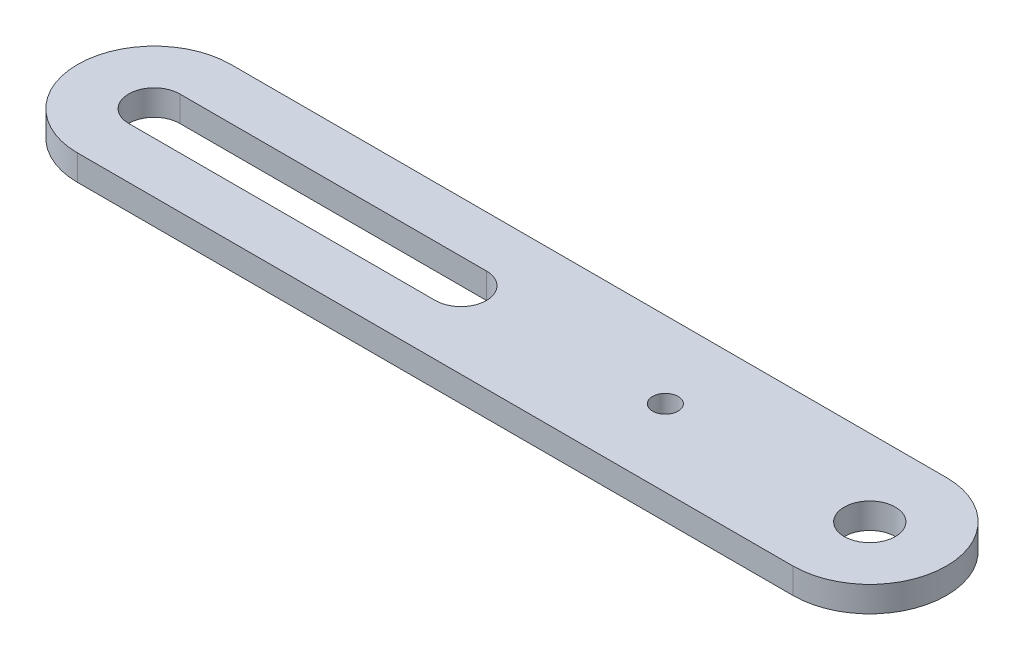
ISO-10303-21;
HEADER;
FILE_DESCRIPTION(('STEP AP214'),'2;1');
FILE_NAME('part.step','',(''),(''),'','','');
FILE_SCHEMA(('AUTOMOTIVE_DESIGN { 1 0 10303 214 1 1 1 1 }'));
ENDSEC;
DATA;
#1=APPLICATION_CONTEXT('core data for automotive mechanical design processes');
#2=APPLICATION_PROTOCOL_DEFINITION('international standard','automotive_design',2000,#1);
#3=PRODUCT_CONTEXT('',#1,'mechanical');
#4=PRODUCT('Part','Part','',(#3));
#5=PRODUCT_RELATED_PRODUCT_CATEGORY('part','',(#4));
#6=PRODUCT_DEFINITION_FORMATION('','',#4);
#7=PRODUCT_DEFINITION_CONTEXT('part definition',#1,'design');
#8=PRODUCT_DEFINITION('design','',#6,#7);
#9=PRODUCT_DEFINITION_SHAPE('','',#8);
#10=(LENGTH_UNIT() NAMED_UNIT(*) SI_UNIT(.MILLI.,.METRE.));
#11=(NAMED_UNIT(*) PLANE_ANGLE_UNIT() SI_UNIT($,.RADIAN.));
#12=(NAMED_UNIT(*) SI_UNIT($,.STERADIAN.) SOLID_ANGLE_UNIT());
#13=UNCERTAINTY_MEASURE_WITH_UNIT(LENGTH_MEASURE(1.E-05),#10,'distance_accuracy_value','');
#14=(GEOMETRIC_REPRESENTATION_CONTEXT(3) GLOBAL_UNCERTAINTY_ASSIGNED_CONTEXT((#13)) GLOBAL_UNIT_ASSIGNED_CONTEXT((#10,
#11,#12)) REPRESENTATION_CONTEXT('',''));
#15=CARTESIAN_POINT('',(0.,0.,0.));
#16=DIRECTION('',(0.,0.,1.));
#17=DIRECTION('',(1.,0.,0.));
#18=AXIS2_PLACEMENT_3D('',#15,#16,#17);
#19=CARTESIAN_POINT('',(88.9,3.175,0.));
#20=DIRECTION('',(0.,-1.,0.));
#21=DIRECTION('',(0.,0.,-1.));
#22=AXIS2_PLACEMENT_3D('',#19,#20,#21);
#23=CYLINDRICAL_SURFACE('',#22,19.05);
#24=CARTESIAN_POINT('',(88.9,-3.175,0.));
#25=DIRECTION('',(0.,1.,0.));
#26=DIRECTION('',(0.,0.,-1.));
#27=AXIS2_PLACEMENT_3D('',#24,#25,#26);
#28=CIRCLE('',#27,19.05);
#29=CARTESIAN_POINT('',(88.9,-3.175,19.05));
#30=VERTEX_POINT('',#29);
#31=CARTESIAN_POINT('',(88.9,-3.175,-19.05));
#32=VERTEX_POINT('',#31);
#33=EDGE_CURVE('E142',#30,#32,#28,.T.);
#34=ORIENTED_EDGE('',*,*,#33,.T.);
#35=DIRECTION('',(0.,-1.,0.));
#36=VECTOR('',#35,1.);
#37=CARTESIAN_POINT('',(88.9,3.175,-19.05));
#38=LINE('',#37,#36);
#39=CARTESIAN_POINT('',(88.9,3.175,-19.05));
#40=VERTEX_POINT('',#39);
#41=EDGE_CURVE('E11',#40,#32,#38,.T.);
#42=ORIENTED_EDGE('',*,*,#41,.F.);
#43=CARTESIAN_POINT('',(88.9,3.175,0.));
#44=DIRECTION('',(0.,1.,0.));
#45=DIRECTION('',(0.,0.,-1.));
#46=AXIS2_PLACEMENT_3D('',#43,#44,#45);
#47=CIRCLE('',#46,19.05);
#48=CARTESIAN_POINT('',(88.9,3.175,19.05));
#49=VERTEX_POINT('',#48);
#50=EDGE_CURVE('E145',#49,#40,#47,.T.);
#51=ORIENTED_EDGE('',*,*,#50,.F.);
#52=DIRECTION('',(0.,-1.,0.));
#53=VECTOR('',#52,1.);
#54=CARTESIAN_POINT('',(88.9,3.175,19.05));
#55=LINE('',#54,#53);
#56=EDGE_CURVE('E155',#49,#30,#55,.T.);
#57=ORIENTED_EDGE('',*,*,#56,.T.);
#58=EDGE_LOOP('',(#34,#42,#51,#57));
#59=FACE_BOUND('',#58,.T.);
#60=ADVANCED_FACE('F32',(#59),#23,.T.);
#61=CARTESIAN_POINT('',(-88.9,3.175,-19.05));
#62=DIRECTION('',(0.,0.,1.));
#63=DIRECTION('',(1.,0.,0.));
#64=AXIS2_PLACEMENT_3D('',#61,#62,#63);
#65=PLANE('',#64);
#66=DIRECTION('',(-1.,0.,0.));
#67=VECTOR('',#66,1.);
#68=CARTESIAN_POINT('',(-88.9,-3.175,-19.05));
#69=LINE('',#68,#67);
#70=CARTESIAN_POINT('',(-88.9,-3.175,-19.05));
#71=VERTEX_POINT('',#70);
#72=EDGE_CURVE('E158',#32,#71,#69,.T.);
#73=ORIENTED_EDGE('',*,*,#72,.T.);
#74=DIRECTION('',(0.,-1.,0.));
#75=VECTOR('',#74,1.);
#76=CARTESIAN_POINT('',(-88.9,3.175,-19.05));
#77=LINE('',#76,#75);
#78=CARTESIAN_POINT('',(-88.9,3.175,-19.05));
#79=VERTEX_POINT('',#78);
#80=EDGE_CURVE('E39',#79,#71,#77,.T.);
#81=ORIENTED_EDGE('',*,*,#80,.F.);
#82=DIRECTION('',(-1.,0.,0.));
#83=VECTOR('',#82,1.);
#84=CARTESIAN_POINT('',(-88.9,3.175,-19.05));
#85=LINE('',#84,#83);
#86=EDGE_CURVE('E148',#40,#79,#85,.T.);
#87=ORIENTED_EDGE('',*,*,#86,.F.);
#88=ORIENTED_EDGE('',*,*,#41,.T.);
#89=EDGE_LOOP('',(#73,#81,#87,#88));
#90=FACE_BOUND('',#89,.T.);
#91=ADVANCED_FACE('F187',(#90),#65,.F.);
#92=CARTESIAN_POINT('',(-88.9,3.175,0.));
#93=DIRECTION('',(0.,-1.,0.));
#94=DIRECTION('',(0.,0.,-1.));
#95=AXIS2_PLACEMENT_3D('',#92,#93,#94);
#96=CYLINDRICAL_SURFACE('',#95,19.05);
#97=CARTESIAN_POINT('',(-88.9,-3.175,0.));
#98=DIRECTION('',(0.,1.,0.));
#99=DIRECTION('',(0.,0.,1.));
#100=AXIS2_PLACEMENT_3D('',#97,#98,#99);
#101=CIRCLE('',#100,19.05);
#102=CARTESIAN_POINT('',(-88.9,-3.175,19.05));
#103=VERTEX_POINT('',#102);
#104=EDGE_CURVE('E160',#71,#103,#101,.T.);
#105=ORIENTED_EDGE('',*,*,#104,.T.);
#106=DIRECTION('',(0.,-1.,0.));
#107=VECTOR('',#106,1.);
#108=CARTESIAN_POINT('',(-88.9,3.175,19.05));
#109=LINE('',#108,#107);
#110=CARTESIAN_POINT('',(-88.9,3.175,19.05));
#111=VERTEX_POINT('',#110);
#112=EDGE_CURVE('E165',#111,#103,#109,.T.);
#113=ORIENTED_EDGE('',*,*,#112,.F.);
#114=CARTESIAN_POINT('',(-88.9,3.175,0.));
#115=DIRECTION('',(0.,1.,0.));
#116=DIRECTION('',(0.,0.,1.));
#117=AXIS2_PLACEMENT_3D('',#114,#115,#116);
#118=CIRCLE('',#117,19.05);
#119=EDGE_CURVE('E151',#79,#111,#118,.T.);
#120=ORIENTED_EDGE('',*,*,#119,.F.);
#121=ORIENTED_EDGE('',*,*,#80,.T.);
#122=EDGE_LOOP('',(#105,#113,#120,#121));
#123=FACE_BOUND('',#122,.T.);
#124=ADVANCED_FACE('F172',(#123),#96,.T.);
#125=CARTESIAN_POINT('',(-88.9,3.175,19.05));
#126=DIRECTION('',(0.,0.,-1.));
#127=DIRECTION('',(-1.,0.,0.));
#128=AXIS2_PLACEMENT_3D('',#125,#126,#127);
#129=PLANE('',#128);
#130=DIRECTION('',(1.,0.,0.));
#131=VECTOR('',#130,1.);
#132=CARTESIAN_POINT('',(-88.9,-3.175,19.05));
#133=LINE('',#132,#131);
#134=EDGE_CURVE('E149',#103,#30,#133,.T.);
#135=ORIENTED_EDGE('',*,*,#134,.T.);
#136=ORIENTED_EDGE('',*,*,#56,.F.);
#137=DIRECTION('',(1.,0.,0.));
#138=VECTOR('',#137,1.);
#139=CARTESIAN_POINT('',(-88.9,3.175,19.05));
#140=LINE('',#139,#138);
#141=EDGE_CURVE('E153',#111,#49,#140,.T.);
#142=ORIENTED_EDGE('',*,*,#141,.F.);
#143=ORIENTED_EDGE('',*,*,#112,.T.);
#144=EDGE_LOOP('',(#135,#136,#142,#143));
#145=FACE_BOUND('',#144,.T.);
#146=ADVANCED_FACE('F180',(#145),#129,.F.);
#147=CARTESIAN_POINT('',(88.9,3.175,0.));
#148=DIRECTION('',(0.,-1.,0.));
#149=DIRECTION('',(0.,0.,-1.));
#150=AXIS2_PLACEMENT_3D('',#147,#148,#149);
#151=PLANE('',#150);
#152=DIRECTION('',(1.,0.,0.));
#153=VECTOR('',#152,1.);
#154=CARTESIAN_POINT('',(-88.9,3.175,6.35));
#155=LINE('',#154,#153);
#156=CARTESIAN_POINT('',(-88.9,3.175,6.35));
#157=VERTEX_POINT('',#156);
#158=CARTESIAN_POINT('',(-12.7,3.175,6.35));
#159=VERTEX_POINT('',#158);
#160=EDGE_CURVE('E123',#157,#159,#155,.T.);
#161=ORIENTED_EDGE('',*,*,#160,.F.);
#162=CARTESIAN_POINT('',(-88.9,3.175,0.));
#163=DIRECTION('',(0.,1.,0.));
#164=DIRECTION('',(0.,0.,1.));
#165=AXIS2_PLACEMENT_3D('',#162,#163,#164);
#166=CIRCLE('',#165,6.35);
#167=CARTESIAN_POINT('',(-88.9,3.175,-6.35));
#168=VERTEX_POINT('',#167);
#169=EDGE_CURVE('E46',#168,#157,#166,.T.);
#170=ORIENTED_EDGE('',*,*,#169,.F.);
#171=DIRECTION('',(-1.,0.,0.));
#172=VECTOR('',#171,1.);
#173=CARTESIAN_POINT('',(-88.9,3.175,-6.35));
#174=LINE('',#173,#172);
#175=CARTESIAN_POINT('',(-12.7,3.175,-6.35));
#176=VERTEX_POINT('',#175);
#177=EDGE_CURVE('E114',#176,#168,#174,.T.);
#178=ORIENTED_EDGE('',*,*,#177,.F.);
#179=CARTESIAN_POINT('',(-12.7,3.175,0.));
#180=DIRECTION('',(0.,1.,0.));
#181=DIRECTION('',(0.,0.,1.));
#182=AXIS2_PLACEMENT_3D('',#179,#180,#181);
#183=CIRCLE('',#182,6.35);
#184=EDGE_CURVE('E117',#159,#176,#183,.T.);
#185=ORIENTED_EDGE('',*,*,#184,.F.);
#186=EDGE_LOOP('',(#161,#170,#178,#185));
#187=FACE_BOUND('',#186,.T.);
#188=CARTESIAN_POINT('',(38.1,3.175,0.));
#189=DIRECTION('',(0.,1.,0.));
#190=DIRECTION('',(0.,0.,1.));
#191=AXIS2_PLACEMENT_3D('',#188,#189,#190);
#192=CIRCLE('',#191,3.175);
#193=CARTESIAN_POINT('',(38.1,3.175,3.175));
#194=VERTEX_POINT('',#193);
#195=EDGE_CURVE('E129',#194,#194,#192,.T.);
#196=ORIENTED_EDGE('',*,*,#195,.F.);
#197=EDGE_LOOP('',(#196));
#198=FACE_BOUND('',#197,.T.);
#199=CARTESIAN_POINT('',(88.9,3.175,0.));
#200=DIRECTION('',(0.,1.,0.));
#201=DIRECTION('',(0.,0.,1.));
#202=AXIS2_PLACEMENT_3D('',#199,#200,#201);
#203=CIRCLE('',#202,6.35);
#204=CARTESIAN_POINT('',(88.9,3.175,6.35));
#205=VERTEX_POINT('',#204);
#206=EDGE_CURVE('E136',#205,#205,#203,.T.);
#207=ORIENTED_EDGE('',*,*,#206,.F.);
#208=EDGE_LOOP('',(#207));
#209=FACE_BOUND('',#208,.T.);
#210=ORIENTED_EDGE('',*,*,#50,.T.);
#211=ORIENTED_EDGE('',*,*,#86,.T.);
#212=ORIENTED_EDGE('',*,*,#119,.T.);
#213=ORIENTED_EDGE('',*,*,#141,.T.);
#214=EDGE_LOOP('',(#210,#211,#212,#213));
#215=FACE_BOUND('',#214,.T.);
#216=ADVANCED_FACE('F186',(#187,#198,#209,#215),#151,.F.);
#217=CARTESIAN_POINT('',(88.9,-3.175,0.));
#218=DIRECTION('',(0.,-1.,0.));
#219=DIRECTION('',(0.,0.,-1.));
#220=AXIS2_PLACEMENT_3D('',#217,#218,#219);
#221=PLANE('',#220);
#222=CARTESIAN_POINT('',(-88.9,-3.175,0.));
#223=DIRECTION('',(0.,1.,0.));
#224=DIRECTION('',(0.,0.,1.));
#225=AXIS2_PLACEMENT_3D('',#222,#223,#224);
#226=CIRCLE('',#225,6.35);
#227=CARTESIAN_POINT('',(-88.9,-3.175,-6.35));
#228=VERTEX_POINT('',#227);
#229=CARTESIAN_POINT('',(-88.9,-3.175,6.35));
#230=VERTEX_POINT('',#229);
#231=EDGE_CURVE('E98',#228,#230,#226,.T.);
#232=ORIENTED_EDGE('',*,*,#231,.T.);
#233=DIRECTION('',(1.,0.,0.));
#234=VECTOR('',#233,1.);
#235=CARTESIAN_POINT('',(-88.9,-3.175,6.35));
#236=LINE('',#235,#234);
#237=CARTESIAN_POINT('',(-12.7,-3.175,6.35));
#238=VERTEX_POINT('',#237);
#239=EDGE_CURVE('E107',#230,#238,#236,.T.);
#240=ORIENTED_EDGE('',*,*,#239,.T.);
#241=CARTESIAN_POINT('',(-12.7,-3.175,0.));
#242=DIRECTION('',(0.,1.,0.));
#243=DIRECTION('',(0.,0.,1.));
#244=AXIS2_PLACEMENT_3D('',#241,#242,#243);
#245=CIRCLE('',#244,6.35);
#246=CARTESIAN_POINT('',(-12.7,-3.175,-6.35));
#247=VERTEX_POINT('',#246);
#248=EDGE_CURVE('E54',#238,#247,#245,.T.);
#249=ORIENTED_EDGE('',*,*,#248,.T.);
#250=DIRECTION('',(-1.,0.,0.));
#251=VECTOR('',#250,1.);
#252=CARTESIAN_POINT('',(-88.9,-3.175,-6.35));
#253=LINE('',#252,#251);
#254=EDGE_CURVE('E104',#247,#228,#253,.T.);
#255=ORIENTED_EDGE('',*,*,#254,.T.);
#256=EDGE_LOOP('',(#232,#240,#249,#255));
#257=FACE_BOUND('',#256,.T.);
#258=CARTESIAN_POINT('',(38.1,-3.175,0.));
#259=DIRECTION('',(0.,1.,0.));
#260=DIRECTION('',(0.,0.,1.));
#261=AXIS2_PLACEMENT_3D('',#258,#259,#260);
#262=CIRCLE('',#261,3.175);
#263=CARTESIAN_POINT('',(38.1,-3.175,3.175));
#264=VERTEX_POINT('',#263);
#265=EDGE_CURVE('E133',#264,#264,#262,.T.);
#266=ORIENTED_EDGE('',*,*,#265,.T.);
#267=EDGE_LOOP('',(#266));
#268=FACE_BOUND('',#267,.T.);
#269=CARTESIAN_POINT('',(88.9,-3.175,0.));
#270=DIRECTION('',(0.,1.,0.));
#271=DIRECTION('',(0.,0.,1.));
#272=AXIS2_PLACEMENT_3D('',#269,#270,#271);
#273=CIRCLE('',#272,6.35);
#274=CARTESIAN_POINT('',(88.9,-3.175,6.35));
#275=VERTEX_POINT('',#274);
#276=EDGE_CURVE('E139',#275,#275,#273,.T.);
#277=ORIENTED_EDGE('',*,*,#276,.T.);
#278=EDGE_LOOP('',(#277));
#279=FACE_BOUND('',#278,.T.);
#280=ORIENTED_EDGE('',*,*,#33,.F.);
#281=ORIENTED_EDGE('',*,*,#134,.F.);
#282=ORIENTED_EDGE('',*,*,#104,.F.);
#283=ORIENTED_EDGE('',*,*,#72,.F.);
#284=EDGE_LOOP('',(#280,#281,#282,#283));
#285=FACE_BOUND('',#284,.T.);
#286=ADVANCED_FACE('F111',(#257,#268,#279,#285),#221,.T.);
#287=CARTESIAN_POINT('',(88.9,-3.175,0.));
#288=DIRECTION('',(0.,1.,0.));
#289=DIRECTION('',(0.,0.,1.));
#290=AXIS2_PLACEMENT_3D('',#287,#288,#289);
#291=CYLINDRICAL_SURFACE('',#290,6.35);
#292=ORIENTED_EDGE('',*,*,#276,.F.);
#293=EDGE_LOOP('',(#292));
#294=FACE_BOUND('',#293,.T.);
#295=ORIENTED_EDGE('',*,*,#206,.T.);
#296=EDGE_LOOP('',(#295));
#297=FACE_BOUND('',#296,.T.);
#298=ADVANCED_FACE('F199',(#294,#297),#291,.F.);
#299=CARTESIAN_POINT('',(38.1,-3.175,0.));
#300=DIRECTION('',(0.,1.,0.));
#301=DIRECTION('',(0.,0.,1.));
#302=AXIS2_PLACEMENT_3D('',#299,#300,#301);
#303=CYLINDRICAL_SURFACE('',#302,3.175);
#304=ORIENTED_EDGE('',*,*,#265,.F.);
#305=EDGE_LOOP('',(#304));
#306=FACE_BOUND('',#305,.T.);
#307=ORIENTED_EDGE('',*,*,#195,.T.);
#308=EDGE_LOOP('',(#307));
#309=FACE_BOUND('',#308,.T.);
#310=ADVANCED_FACE('F205',(#306,#309),#303,.F.);
#311=CARTESIAN_POINT('',(-88.9,-3.175,0.));
#312=DIRECTION('',(0.,1.,0.));
#313=DIRECTION('',(0.,0.,1.));
#314=AXIS2_PLACEMENT_3D('',#311,#312,#313);
#315=CYLINDRICAL_SURFACE('',#314,6.35);
#316=ORIENTED_EDGE('',*,*,#169,.T.);
#317=DIRECTION('',(0.,1.,0.));
#318=VECTOR('',#317,1.);
#319=CARTESIAN_POINT('',(-88.9,-3.175,6.35));
#320=LINE('',#319,#318);
#321=EDGE_CURVE('E94',#230,#157,#320,.T.);
#322=ORIENTED_EDGE('',*,*,#321,.F.);
#323=ORIENTED_EDGE('',*,*,#231,.F.);
#324=DIRECTION('',(0.,1.,0.));
#325=VECTOR('',#324,1.);
#326=CARTESIAN_POINT('',(-88.9,-3.175,-6.35));
#327=LINE('',#326,#325);
#328=EDGE_CURVE('E127',#228,#168,#327,.T.);
#329=ORIENTED_EDGE('',*,*,#328,.T.);
#330=EDGE_LOOP('',(#316,#322,#323,#329));
#331=FACE_BOUND('',#330,.T.);
#332=ADVANCED_FACE('F96',(#331),#315,.F.);
#333=CARTESIAN_POINT('',(-88.9,-3.175,-6.35));
#334=DIRECTION('',(0.,0.,-1.));
#335=DIRECTION('',(-1.,0.,0.));
#336=AXIS2_PLACEMENT_3D('',#333,#334,#335);
#337=PLANE('',#336);
#338=ORIENTED_EDGE('',*,*,#177,.T.);
#339=ORIENTED_EDGE('',*,*,#328,.F.);
#340=ORIENTED_EDGE('',*,*,#254,.F.);
#341=DIRECTION('',(0.,1.,0.));
#342=VECTOR('',#341,1.);
#343=CARTESIAN_POINT('',(-12.7,-3.175,-6.35));
#344=LINE('',#343,#342);
#345=EDGE_CURVE('E130',#247,#176,#344,.T.);
#346=ORIENTED_EDGE('',*,*,#345,.T.);
#347=EDGE_LOOP('',(#338,#339,#340,#346));
#348=FACE_BOUND('',#347,.T.);
#349=ADVANCED_FACE('F212',(#348),#337,.F.);
#350=CARTESIAN_POINT('',(-12.7,-3.175,0.));
#351=DIRECTION('',(0.,1.,0.));
#352=DIRECTION('',(0.,0.,1.));
#353=AXIS2_PLACEMENT_3D('',#350,#351,#352);
#354=CYLINDRICAL_SURFACE('',#353,6.35);
#355=ORIENTED_EDGE('',*,*,#184,.T.);
#356=ORIENTED_EDGE('',*,*,#345,.F.);
#357=ORIENTED_EDGE('',*,*,#248,.F.);
#358=DIRECTION('',(0.,1.,0.));
#359=VECTOR('',#358,1.);
#360=CARTESIAN_POINT('',(-12.7,-3.175,6.35));
#361=LINE('',#360,#359);
#362=EDGE_CURVE('E103',#238,#159,#361,.T.);
#363=ORIENTED_EDGE('',*,*,#362,.T.);
#364=EDGE_LOOP('',(#355,#356,#357,#363));
#365=FACE_BOUND('',#364,.T.);
#366=ADVANCED_FACE('F215',(#365),#354,.F.);
#367=CARTESIAN_POINT('',(-88.9,-3.175,6.35));
#368=DIRECTION('',(0.,0.,1.));
#369=DIRECTION('',(1.,0.,0.));
#370=AXIS2_PLACEMENT_3D('',#367,#368,#369);
#371=PLANE('',#370);
#372=ORIENTED_EDGE('',*,*,#160,.T.);
#373=ORIENTED_EDGE('',*,*,#362,.F.);
#374=ORIENTED_EDGE('',*,*,#239,.F.);
#375=ORIENTED_EDGE('',*,*,#321,.T.);
#376=EDGE_LOOP('',(#372,#373,#374,#375));
#377=FACE_BOUND('',#376,.T.);
#378=ADVANCED_FACE('F108',(#377),#371,.F.);
#379=CLOSED_SHELL('',(#60,#91,#124,#146,#216,#286,#298,#310,#332,#349,#366,#378));
#380=MANIFOLD_SOLID_BREP('B2',#379);
#381=ADVANCED_BREP_SHAPE_REPRESENTATION('',(#18,#380),#14);
#382=SHAPE_DEFINITION_REPRESENTATION(#9,#381);
ENDSEC;
END-ISO-10303-21;
